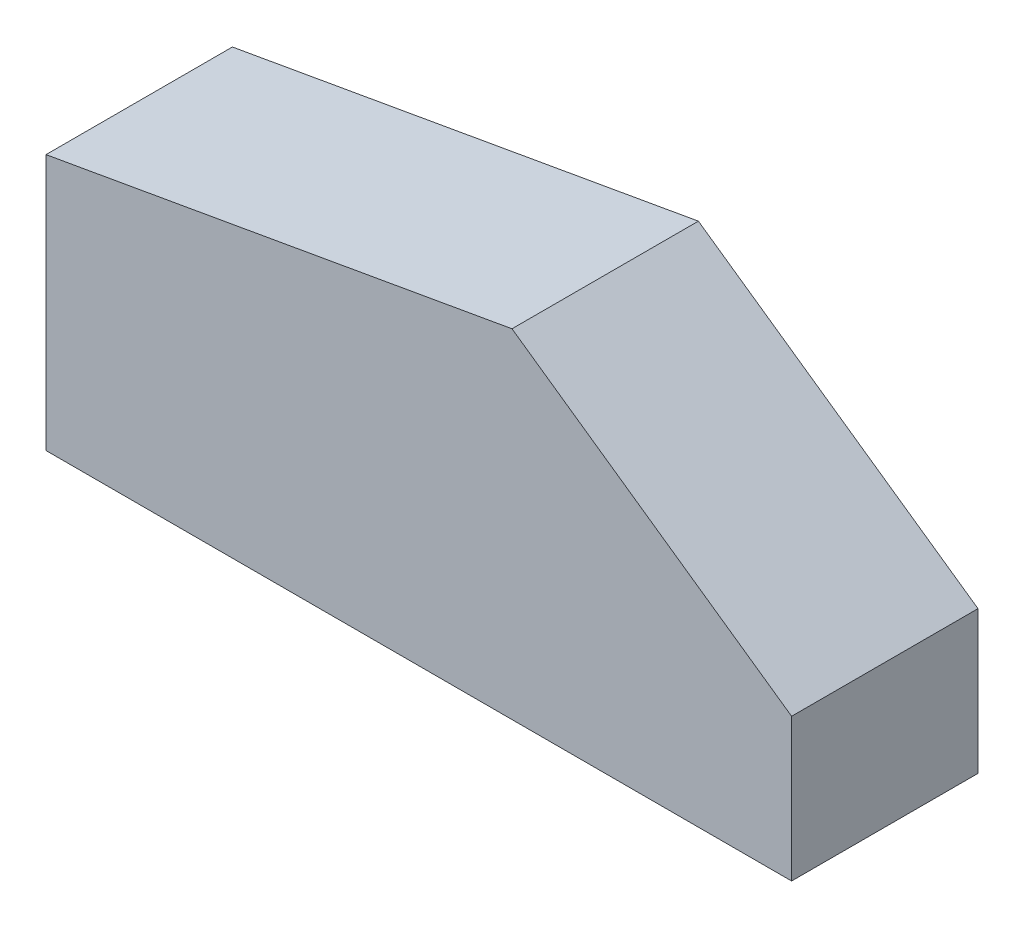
from build123d import *

# Parameters (mm, degrees)
EXTRUDE1_DEPTH = 25.4


with BuildPart() as part:
    # Sketch1 → Extrude1 (new body)
    with BuildSketch(Plane.XY):
        Polygon((0, 0), (101.6, 0), (101.6, 19.443856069), (63.5, 46.121763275), (0, 34.925), align=None)
    extrude(amount=EXTRUDE1_DEPTH)


solid = part.part
